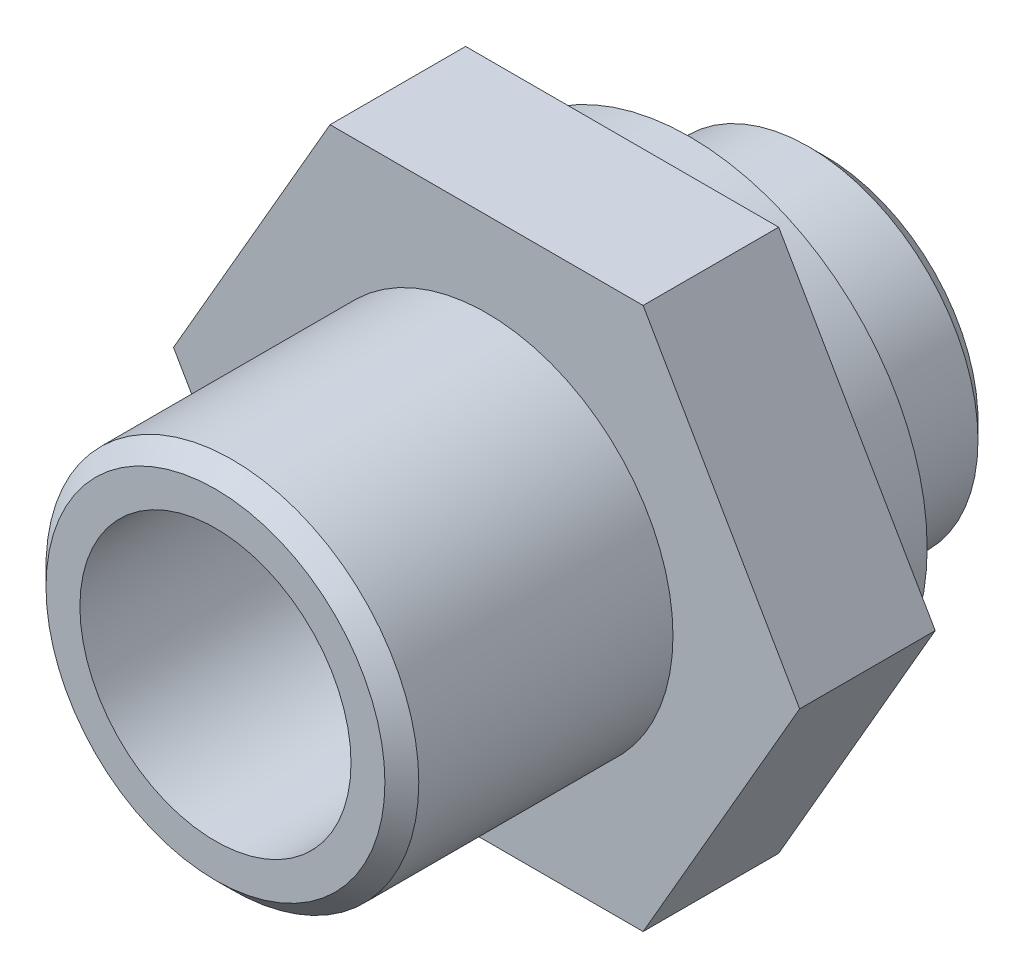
from build123d import *

# Parameters (mm, degrees)
BOSS_EXTRUDE1_DEPTH = 2
SKETCH2_R           = 2.75
BOSS_EXTRUDE2_DEPTH = 4
SKETCH3_R           = 3.5
BOSS_EXTRUDE3_DEPTH = 1
SKETCH4_R           = 2.5
BOSS_EXTRUDE4_DEPTH = 2
SKETCH5_R           = 2
CUT_EXTRUDE1_DEPTH  = 10
CHAMFER1_SIZE       = 0.25


with BuildPart() as part:
    # Sketch1 → Boss-Extrude1 (new body)
    with BuildSketch(Plane.XY):
        Polygon((-4.618802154, 0), (-2.309401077, -4), (2.309401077, -4), (4.618802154, 0), (2.309401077, 4), (-2.309401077, 4), align=None)
    extrude(amount=BOSS_EXTRUDE1_DEPTH)

    # Sketch2 → Boss-Extrude2 (add)
    with BuildSketch(Plane.XY.offset(2)):
        Circle(SKETCH2_R)
    extrude(amount=BOSS_EXTRUDE2_DEPTH)

    # Sketch3 → Boss-Extrude3 (add)
    with BuildSketch(Plane(origin=(0, 0, 0), x_dir=(-1, 0, 0), z_dir=(0, 0, -1))):
        Circle(SKETCH3_R)
    extrude(amount=BOSS_EXTRUDE3_DEPTH)

    # Sketch4 → Boss-Extrude4 (add)
    with BuildSketch(Plane(origin=(0, 0, -1), x_dir=(-1, 0, 0), z_dir=(0, 0, -1))):
        Circle(SKETCH4_R)
    extrude(amount=BOSS_EXTRUDE4_DEPTH)

    # Sketch5 → Cut-Extrude1 (cut)
    with BuildSketch(Plane(origin=(0, 0, -3), x_dir=(-1, 0, 0), z_dir=(0, 0, -1))):
        Circle(SKETCH5_R)
    extrude(amount=-CUT_EXTRUDE1_DEPTH, mode=Mode.SUBTRACT)

    # Chamfer1
    chamfer1_edges = [part.edges().sort_by_distance(p)[0] for p in [
        (-2.75, 0, 6),
        (2.5, 0, -3),
    ]]
    chamfer(chamfer1_edges, length=CHAMFER1_SIZE)


solid = part.part
